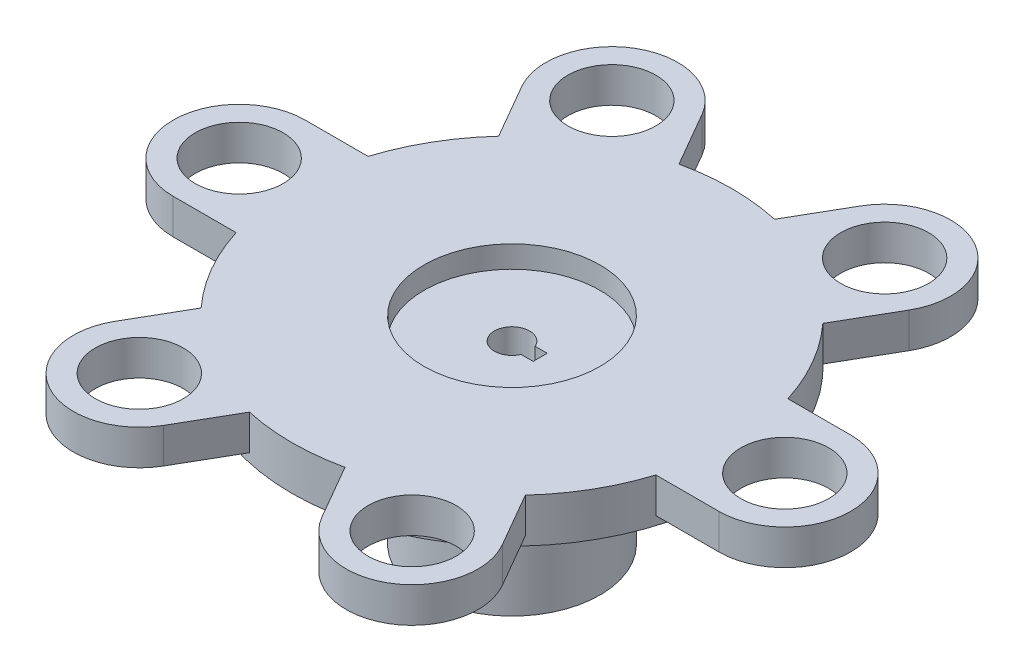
from build123d import *

# Parameters (mm, degrees)
SKETCH_1_R          = 10
SKETCH_1_R_2        = 2
EXTRUDE_1_DEPTH     = 10
SKETCH_2_W          = 1.602111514
SKETCH_2_H          = 1.6
CUT_EXTRUDE_1_DEPTH = 30
SKETCH_3_R          = 25
SKETCH_3_R_2        = 10
EXTRUDE_2_DEPTH     = 2.5
EXTRUDE_3_DEPTH     = 4
SKETCH_5_R          = 5
CUT_EXTRUDE_2_DEPTH = 8


with BuildPart() as part:
    # Sketch 1 → Extrude 1 (new, symmetric)
    with BuildSketch(Plane(origin=(0, 0, 0), x_dir=(1, 0, 0), z_dir=(0, 1, 0))):
        with Locations(Location((0, 0, 0), (0, 0, 270))):
            Circle(SKETCH_1_R)
        with Locations(Location((0, 0, 0), (0, 0, 270))):
            Circle(SKETCH_1_R_2, mode=Mode.SUBTRACT)
    extrude(amount=EXTRUDE_1_DEPTH, both=True)

    # Sketch 2 → Cut-Extrude 1 (cut)
    with BuildSketch(Plane(origin=(0, 10, 0), x_dir=(1, 0, 0), z_dir=(0, 1, 0))):
        with Locations((2.398944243, 0)):
            Rectangle(SKETCH_2_W, SKETCH_2_H)
    extrude(amount=-CUT_EXTRUDE_1_DEPTH, mode=Mode.SUBTRACT)

    # Sketch 3 → Extrude 2 (add, symmetric)
    with BuildSketch(Plane(origin=(0, 10, 0), x_dir=(1, 0, 0), z_dir=(0, 1, 0))):
        with Locations(Location((0, 0, 0), (0, 0, 270))):
            Circle(SKETCH_3_R)
        with Locations(Location((0, 0, 0), (0, 0, 270))):
            Circle(SKETCH_3_R_2, mode=Mode.SUBTRACT)
    extrude(amount=EXTRUDE_2_DEPTH, both=True)

    # Sketch 4 → Extrude 3 (add)
    with BuildSketch(Plane(origin=(0, 12.5, 0), x_dir=(1, 0, 0), z_dir=(0, 1, 0))):
        with BuildLine():
            Line((31, 7.5), (19.369908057, 7.5))
            Line((19.369908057, 7.5), (19.369908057, -7.5))
            Line((19.369908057, -7.5), (31, -7.5))
            ThreePointArc((31, -7.5), (38.5, 0), (31, 7.5))
        make_face()
        with BuildLine():
            Line((9.004809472, -30.596787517), (3.1897635, -20.524832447))
            Line((3.1897635, -20.524832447), (16.180144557, -13.024832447))
            Line((16.180144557, -13.024832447), (21.995190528, -23.096787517))
            ThreePointArc((21.995190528, -23.096787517), (19.25, -33.341978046), (9.004809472, -30.596787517))
        make_face()
        with BuildLine():
            Line((-21.995190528, -23.096787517), (-16.180144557, -13.024832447))
            Line((-16.180144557, -13.024832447), (-3.1897635, -20.524832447))
            Line((-3.1897635, -20.524832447), (-9.004809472, -30.596787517))
            ThreePointArc((-9.004809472, -30.596787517), (-19.25, -33.341978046), (-21.995190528, -23.096787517))
        make_face()
        with BuildLine():
            Line((-31, 7.5), (-19.369908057, 7.5))
            Line((-19.369908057, 7.5), (-19.369908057, -7.5))
            Line((-19.369908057, -7.5), (-31, -7.5))
            ThreePointArc((-31, -7.5), (-38.5, 0), (-31, 7.5))
        make_face()
        with BuildLine():
            Line((-9.004809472, 30.596787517), (-3.1897635, 20.524832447))
            Line((-3.1897635, 20.524832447), (-16.180144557, 13.024832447))
            Line((-16.180144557, 13.024832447), (-21.995190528, 23.096787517))
            ThreePointArc((-21.995190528, 23.096787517), (-19.25, 33.341978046), (-9.004809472, 30.596787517))
        make_face()
        with BuildLine():
            Line((21.995190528, 23.096787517), (16.180144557, 13.024832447))
            Line((16.180144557, 13.024832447), (3.1897635, 20.524832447))
            Line((3.1897635, 20.524832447), (9.004809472, 30.596787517))
            ThreePointArc((9.004809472, 30.596787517), (19.25, 33.341978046), (21.995190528, 23.096787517))
        make_face()
    extrude(amount=-EXTRUDE_3_DEPTH)

    # Sketch 5 → Cut-Extrude 2 (cut)
    with BuildSketch(Plane(origin=(0, 12.5, 0), x_dir=(1, 0, 0), z_dir=(0, 1, 0))):
        with Locations(Location((15.5, -26.846787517, 0), (0, 0, 270))):
            Circle(SKETCH_5_R)
        with Locations(Location((-15.5, -26.846787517, 0), (0, 0, 270))):
            Circle(SKETCH_5_R)
        with Locations(Location((-31, 0, 0), (0, 0, 270))):
            Circle(SKETCH_5_R)
        with Locations(Location((-15.5, 26.846787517, 0), (0, 0, 270))):
            Circle(SKETCH_5_R)
        with Locations(Location((15.5, 26.846787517, 0), (0, 0, 270))):
            Circle(SKETCH_5_R)
        with Locations(Location((31, 0, 0), (0, 0, 270))):
            Circle(SKETCH_5_R)
    extrude(amount=-CUT_EXTRUDE_2_DEPTH, mode=Mode.SUBTRACT)


solid = part.part
